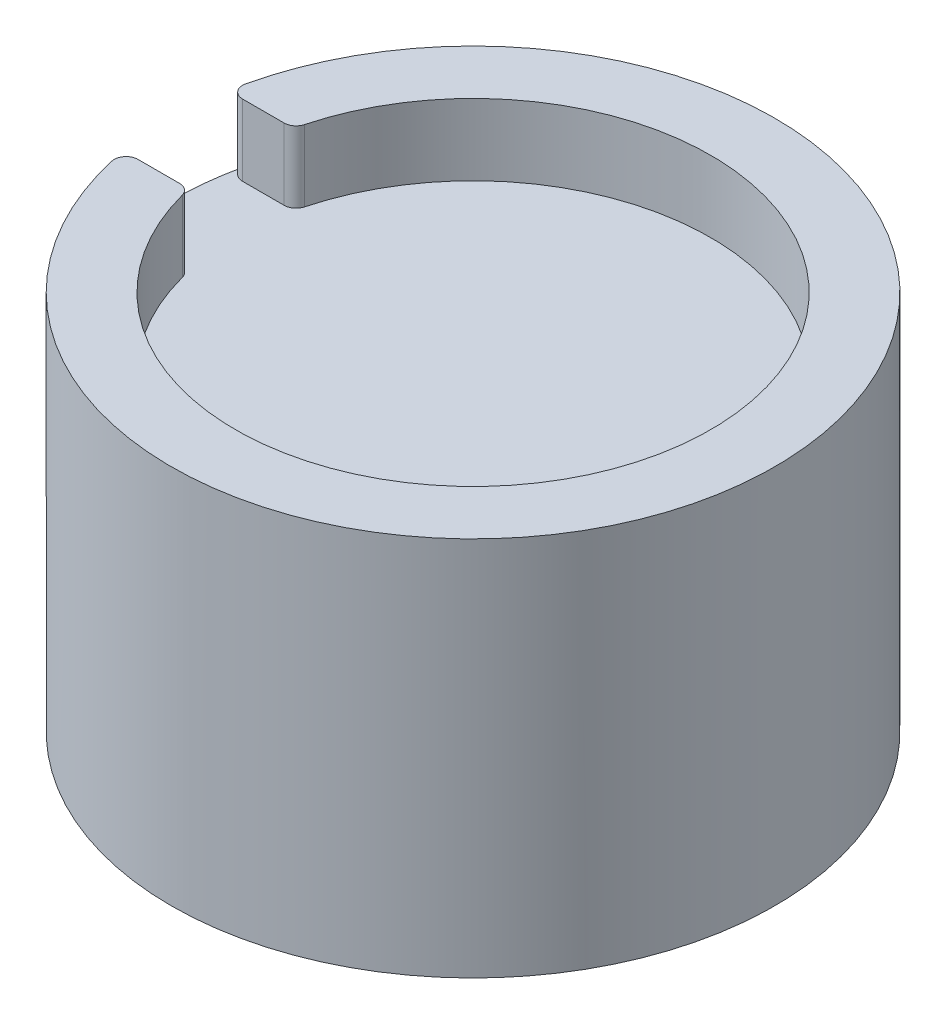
from build123d import *

# Parameters (mm, degrees)
SKETCH2_R                      = 6.35
BOSS_EXTRUDE1_DEPTH            = 4
CUT_EXTRUDE1_DEPTH             = 1.5
FILLET1_R                      = 0.25
F_1_8_0_1250_DOWEL_HOLE1_D     = 3.175
F_1_8_0_1250_DOWEL_HOLE1_DEPTH = 4


with BuildPart() as part:
    # Sketch2 → Boss-Extrude1 (new, symmetric)
    with BuildSketch(Plane(origin=(0, 0, 0), x_dir=(1, 0, 0), z_dir=(0, 1, 0))):
        with Locations(Location((0, 0, 0), (0, 0, 270))):
            Circle(SKETCH2_R)
    extrude(amount=BOSS_EXTRUDE1_DEPTH, both=True)

    # Sketch3 → Cut-Extrude1 (cut)
    with BuildSketch(Plane(origin=(0, 4, 0), x_dir=(1, 0, 0), z_dir=(0, 1, 0))):
        with BuildLine():
            Line((-4.877499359, 1.1), (-6.253998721, 1.1))
            ThreePointArc((-6.253998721, 1.1), (-6.35, 0), (-6.253998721, -1.1))
            Line((-6.253998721, -1.1), (-4.877499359, -1.1))
            ThreePointArc((-4.877499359, -1.1), (5, 0), (-4.877499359, 1.1))
        make_face()
    extrude(amount=-CUT_EXTRUDE1_DEPTH, mode=Mode.SUBTRACT)

    # Fillet1
    fillet1_edges = [part.edges().sort_by_distance(p)[0] for p in [
        (-6.253998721, 3.25, -1.1),
        (-4.877499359, 3.25, -1.1),
        (-4.877499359, 3.25, 1.1),
        (-6.253998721, 3.25, 1.1),
    ]]
    fillet(fillet1_edges, radius=FILLET1_R)

    # 1_8 _0.1250_ Dowel Hole1
    with Locations(Plane(origin=(0, -4, 0), x_dir=(-1, 0, 0), z_dir=(0, -1, 0))):
        with Locations((0, 0)):
            Hole(F_1_8_0_1250_DOWEL_HOLE1_D / 2, depth=F_1_8_0_1250_DOWEL_HOLE1_DEPTH)


solid = part.part
